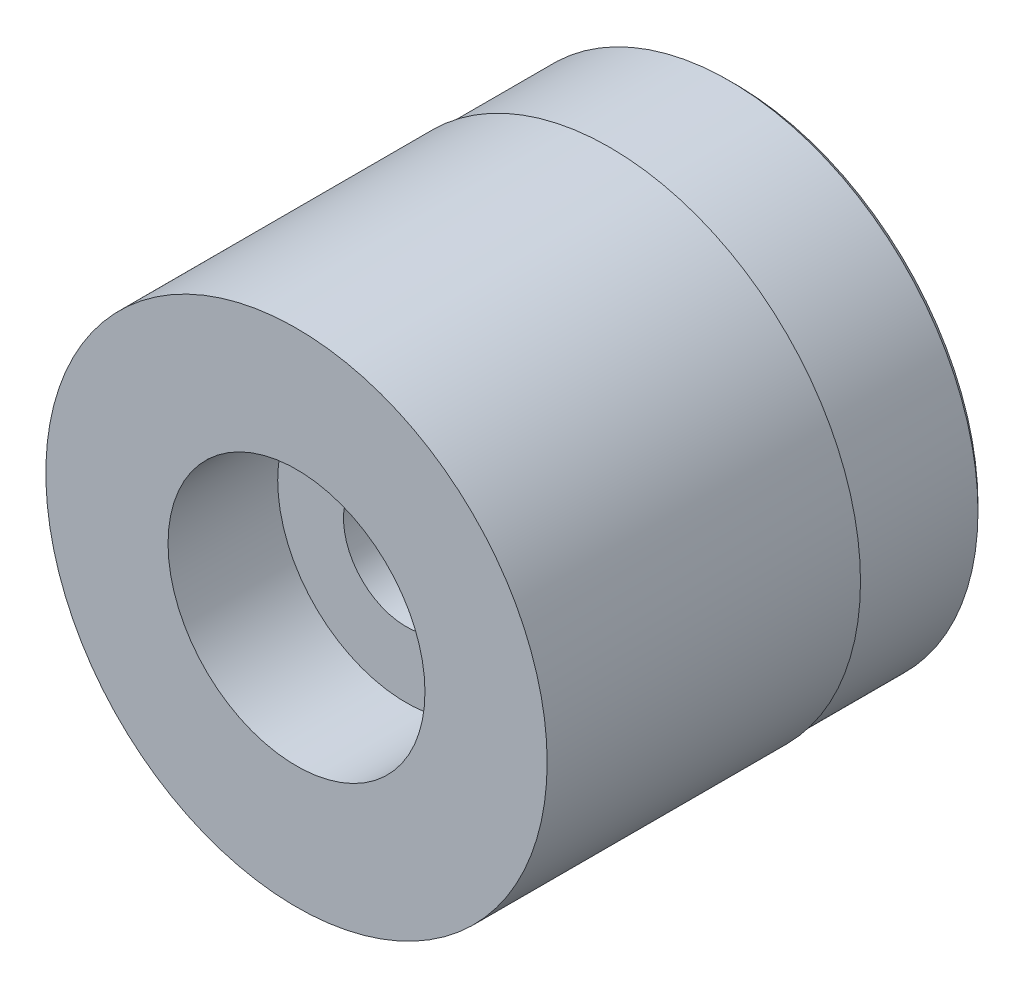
ISO-10303-21;
HEADER;
FILE_DESCRIPTION(('STEP AP214'),'2;1');
FILE_NAME('part.step','',(''),(''),'','','');
FILE_SCHEMA(('AUTOMOTIVE_DESIGN { 1 0 10303 214 1 1 1 1 }'));
ENDSEC;
DATA;
#1=APPLICATION_CONTEXT('core data for automotive mechanical design processes');
#2=APPLICATION_PROTOCOL_DEFINITION('international standard','automotive_design',2000,#1);
#3=PRODUCT_CONTEXT('',#1,'mechanical');
#4=PRODUCT('Part','Part','',(#3));
#5=PRODUCT_RELATED_PRODUCT_CATEGORY('part','',(#4));
#6=PRODUCT_DEFINITION_FORMATION('','',#4);
#7=PRODUCT_DEFINITION_CONTEXT('part definition',#1,'design');
#8=PRODUCT_DEFINITION('design','',#6,#7);
#9=PRODUCT_DEFINITION_SHAPE('','',#8);
#10=(LENGTH_UNIT() NAMED_UNIT(*) SI_UNIT(.MILLI.,.METRE.));
#11=(NAMED_UNIT(*) PLANE_ANGLE_UNIT() SI_UNIT($,.RADIAN.));
#12=(NAMED_UNIT(*) SI_UNIT($,.STERADIAN.) SOLID_ANGLE_UNIT());
#13=UNCERTAINTY_MEASURE_WITH_UNIT(LENGTH_MEASURE(1.E-05),#10,'distance_accuracy_value','');
#14=(GEOMETRIC_REPRESENTATION_CONTEXT(3) GLOBAL_UNCERTAINTY_ASSIGNED_CONTEXT((#13)) GLOBAL_UNIT_ASSIGNED_CONTEXT((#10,
#11,#12)) REPRESENTATION_CONTEXT('',''));
#15=CARTESIAN_POINT('',(0.,0.,0.));
#16=DIRECTION('',(0.,0.,1.));
#17=DIRECTION('',(1.,0.,0.));
#18=AXIS2_PLACEMENT_3D('',#15,#16,#17);
#19=CARTESIAN_POINT('',(0.,0.,3.79790950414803));
#20=DIRECTION('',(0.,0.,1.));
#21=DIRECTION('',(1.,0.,0.));
#22=AXIS2_PLACEMENT_3D('',#19,#20,#21);
#23=CYLINDRICAL_SURFACE('',#22,8.);
#24=CARTESIAN_POINT('',(0.,0.,0.));
#25=DIRECTION('',(0.,0.,1.));
#26=DIRECTION('',(1.,0.,0.));
#27=AXIS2_PLACEMENT_3D('',#24,#25,#26);
#28=CIRCLE('',#27,8.);
#29=CARTESIAN_POINT('',(8.,0.,0.));
#30=VERTEX_POINT('',#29);
#31=EDGE_CURVE('E10',#30,#30,#28,.T.);
#32=ORIENTED_EDGE('',*,*,#31,.F.);
#33=EDGE_LOOP('',(#32));
#34=FACE_BOUND('',#33,.T.);
#35=CARTESIAN_POINT('',(0.,0.,-10.));
#36=DIRECTION('',(0.,0.,-1.));
#37=DIRECTION('',(-1.,0.,0.));
#38=AXIS2_PLACEMENT_3D('',#35,#36,#37);
#39=CIRCLE('',#38,8.);
#40=CARTESIAN_POINT('',(-8.,0.,-10.));
#41=VERTEX_POINT('',#40);
#42=EDGE_CURVE('E35',#41,#41,#39,.T.);
#43=ORIENTED_EDGE('',*,*,#42,.F.);
#44=EDGE_LOOP('',(#43));
#45=FACE_BOUND('',#44,.T.);
#46=ADVANCED_FACE('F32',(#34,#45),#23,.T.);
#47=CARTESIAN_POINT('',(0.,0.,-14.));
#48=DIRECTION('',(0.,0.,1.));
#49=DIRECTION('',(1.,0.,0.));
#50=AXIS2_PLACEMENT_3D('',#47,#48,#49);
#51=CONICAL_SURFACE('',#50,7.7499999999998,0.785398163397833);
#52=CARTESIAN_POINT('',(0.,0.,-14.));
#53=DIRECTION('',(0.,0.,1.));
#54=DIRECTION('',(1.,0.,0.));
#55=AXIS2_PLACEMENT_3D('',#52,#53,#54);
#56=CIRCLE('',#55,7.7499999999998);
#57=CARTESIAN_POINT('',(7.7499999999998,0.,-14.));
#58=VERTEX_POINT('',#57);
#59=EDGE_CURVE('E53',#58,#58,#56,.T.);
#60=ORIENTED_EDGE('',*,*,#59,.T.);
#61=EDGE_LOOP('',(#60));
#62=FACE_BOUND('',#61,.T.);
#63=CARTESIAN_POINT('',(0.,0.,-13.8149999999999));
#64=DIRECTION('',(0.,0.,1.));
#65=DIRECTION('',(1.,0.,0.));
#66=AXIS2_PLACEMENT_3D('',#63,#64,#65);
#67=CIRCLE('',#66,7.935);
#68=CARTESIAN_POINT('',(7.935,0.,-13.8149999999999));
#69=VERTEX_POINT('',#68);
#70=EDGE_CURVE('E47',#69,#69,#67,.T.);
#71=ORIENTED_EDGE('',*,*,#70,.F.);
#72=EDGE_LOOP('',(#71));
#73=FACE_BOUND('',#72,.T.);
#74=ADVANCED_FACE('F79',(#62,#73),#51,.T.);
#75=CARTESIAN_POINT('',(0.,8.,0.));
#76=DIRECTION('',(0.,0.,-1.));
#77=DIRECTION('',(-1.,0.,0.));
#78=AXIS2_PLACEMENT_3D('',#75,#76,#77);
#79=PLANE('',#78);
#80=CARTESIAN_POINT('',(0.,0.,0.));
#81=DIRECTION('',(0.,0.,1.));
#82=DIRECTION('',(1.,0.,0.));
#83=AXIS2_PLACEMENT_3D('',#80,#81,#82);
#84=CIRCLE('',#83,4.1);
#85=CARTESIAN_POINT('',(4.1,0.,0.));
#86=VERTEX_POINT('',#85);
#87=EDGE_CURVE('E39',#86,#86,#84,.T.);
#88=ORIENTED_EDGE('',*,*,#87,.F.);
#89=EDGE_LOOP('',(#88));
#90=FACE_BOUND('',#89,.T.);
#91=ORIENTED_EDGE('',*,*,#31,.T.);
#92=EDGE_LOOP('',(#91));
#93=FACE_BOUND('',#92,.T.);
#94=ADVANCED_FACE('F74',(#90,#93),#79,.F.);
#95=CARTESIAN_POINT('',(0.,0.,3.79790950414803));
#96=DIRECTION('',(0.,0.,1.));
#97=DIRECTION('',(1.,0.,0.));
#98=AXIS2_PLACEMENT_3D('',#95,#96,#97);
#99=CYLINDRICAL_SURFACE('',#98,4.1);
#100=CARTESIAN_POINT('',(0.,0.,-3.5));
#101=DIRECTION('',(0.,0.,1.));
#102=DIRECTION('',(1.,0.,0.));
#103=AXIS2_PLACEMENT_3D('',#100,#101,#102);
#104=CIRCLE('',#103,4.1);
#105=CARTESIAN_POINT('',(4.1,0.,-3.5));
#106=VERTEX_POINT('',#105);
#107=EDGE_CURVE('E44',#106,#106,#104,.T.);
#108=ORIENTED_EDGE('',*,*,#107,.F.);
#109=EDGE_LOOP('',(#108));
#110=FACE_BOUND('',#109,.T.);
#111=ORIENTED_EDGE('',*,*,#87,.T.);
#112=EDGE_LOOP('',(#111));
#113=FACE_BOUND('',#112,.T.);
#114=ADVANCED_FACE('F71',(#110,#113),#99,.F.);
#115=CARTESIAN_POINT('',(0.,4.1,-3.5));
#116=DIRECTION('',(0.,0.,-1.));
#117=DIRECTION('',(-1.,0.,0.));
#118=AXIS2_PLACEMENT_3D('',#115,#116,#117);
#119=PLANE('',#118);
#120=CARTESIAN_POINT('',(0.,0.,-3.5));
#121=DIRECTION('',(0.,0.,1.));
#122=DIRECTION('',(1.,0.,0.));
#123=AXIS2_PLACEMENT_3D('',#120,#121,#122);
#124=CIRCLE('',#123,2.);
#125=CARTESIAN_POINT('',(2.,0.,-3.5));
#126=VERTEX_POINT('',#125);
#127=EDGE_CURVE('E64',#126,#126,#124,.T.);
#128=ORIENTED_EDGE('',*,*,#127,.F.);
#129=EDGE_LOOP('',(#128));
#130=FACE_BOUND('',#129,.T.);
#131=ORIENTED_EDGE('',*,*,#107,.T.);
#132=EDGE_LOOP('',(#131));
#133=FACE_BOUND('',#132,.T.);
#134=ADVANCED_FACE('F69',(#130,#133),#119,.F.);
#135=CARTESIAN_POINT('',(0.,0.,3.79790950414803));
#136=DIRECTION('',(0.,0.,1.));
#137=DIRECTION('',(1.,0.,0.));
#138=AXIS2_PLACEMENT_3D('',#135,#136,#137);
#139=CYLINDRICAL_SURFACE('',#138,2.);
#140=CARTESIAN_POINT('',(0.,0.,-14.));
#141=DIRECTION('',(0.,0.,1.));
#142=DIRECTION('',(1.,0.,0.));
#143=AXIS2_PLACEMENT_3D('',#140,#141,#142);
#144=CIRCLE('',#143,2.);
#145=CARTESIAN_POINT('',(2.,0.,-14.));
#146=VERTEX_POINT('',#145);
#147=EDGE_CURVE('E61',#146,#146,#144,.T.);
#148=ORIENTED_EDGE('',*,*,#147,.F.);
#149=EDGE_LOOP('',(#148));
#150=FACE_BOUND('',#149,.T.);
#151=ORIENTED_EDGE('',*,*,#127,.T.);
#152=EDGE_LOOP('',(#151));
#153=FACE_BOUND('',#152,.T.);
#154=ADVANCED_FACE('F103',(#150,#153),#139,.F.);
#155=CARTESIAN_POINT('',(0.,2.,-14.));
#156=DIRECTION('',(0.,0.,1.));
#157=DIRECTION('',(1.,0.,0.));
#158=AXIS2_PLACEMENT_3D('',#155,#156,#157);
#159=PLANE('',#158);
#160=ORIENTED_EDGE('',*,*,#59,.F.);
#161=EDGE_LOOP('',(#160));
#162=FACE_BOUND('',#161,.T.);
#163=ORIENTED_EDGE('',*,*,#147,.T.);
#164=EDGE_LOOP('',(#163));
#165=FACE_BOUND('',#164,.T.);
#166=ADVANCED_FACE('F95',(#162,#165),#159,.F.);
#167=CARTESIAN_POINT('',(0.,8.935,-10.));
#168=DIRECTION('',(0.,0.,-1.));
#169=DIRECTION('',(-1.,0.,0.));
#170=AXIS2_PLACEMENT_3D('',#167,#168,#169);
#171=PLANE('',#170);
#172=CARTESIAN_POINT('',(0.,0.,-10.));
#173=DIRECTION('',(0.,0.,1.));
#174=DIRECTION('',(1.,0.,0.));
#175=AXIS2_PLACEMENT_3D('',#172,#173,#174);
#176=CIRCLE('',#175,7.935);
#177=CARTESIAN_POINT('',(7.935,0.,-10.));
#178=VERTEX_POINT('',#177);
#179=EDGE_CURVE('E49',#178,#178,#176,.T.);
#180=ORIENTED_EDGE('',*,*,#179,.T.);
#181=EDGE_LOOP('',(#180));
#182=FACE_BOUND('',#181,.T.);
#183=ORIENTED_EDGE('',*,*,#42,.T.);
#184=EDGE_LOOP('',(#183));
#185=FACE_BOUND('',#184,.T.);
#186=ADVANCED_FACE('F92',(#182,#185),#171,.T.);
#187=CARTESIAN_POINT('',(0.,0.,0.));
#188=DIRECTION('',(0.,0.,1.));
#189=DIRECTION('',(1.,0.,0.));
#190=AXIS2_PLACEMENT_3D('',#187,#188,#189);
#191=CYLINDRICAL_SURFACE('',#190,7.935);
#192=ORIENTED_EDGE('',*,*,#179,.F.);
#193=EDGE_LOOP('',(#192));
#194=FACE_BOUND('',#193,.T.);
#195=ORIENTED_EDGE('',*,*,#70,.T.);
#196=EDGE_LOOP('',(#195));
#197=FACE_BOUND('',#196,.T.);
#198=ADVANCED_FACE('F94',(#194,#197),#191,.T.);
#199=CLOSED_SHELL('',(#46,#74,#94,#114,#134,#154,#166,#186,#198));
#200=MANIFOLD_SOLID_BREP('B2',#199);
#201=ADVANCED_BREP_SHAPE_REPRESENTATION('',(#18,#200),#14);
#202=SHAPE_DEFINITION_REPRESENTATION(#9,#201);
ENDSEC;
END-ISO-10303-21;
